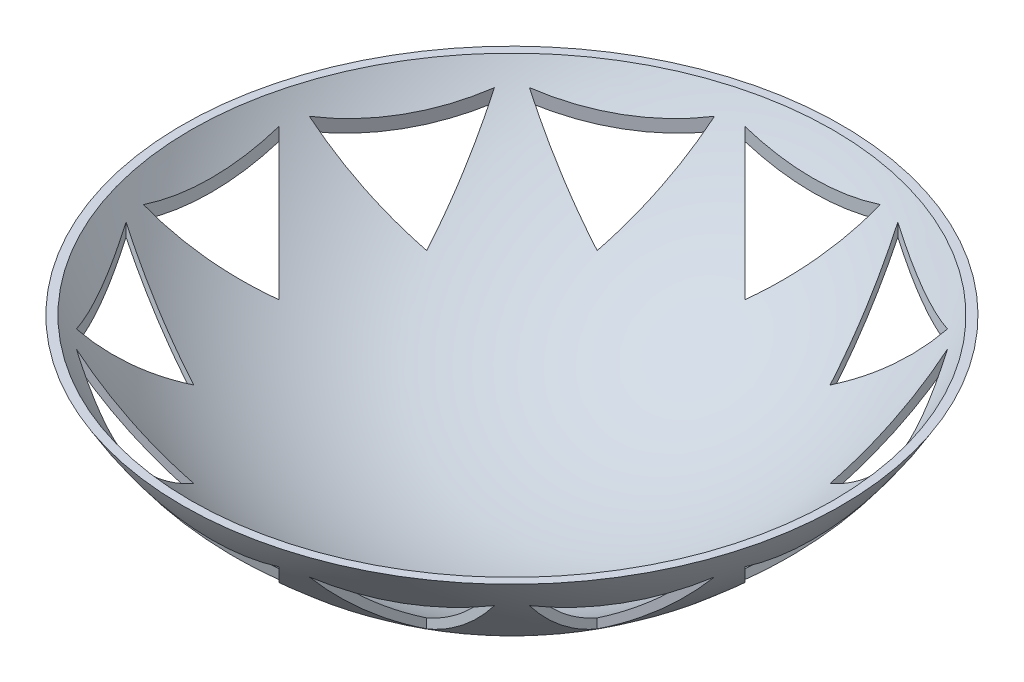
from build123d import *

# Parameters (mm, degrees)
SKETCH2_R      = 0.0005
EXTRUDE1_DEPTH = 81.950602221
EXTRUDE2_DEPTH = 81.950602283


with BuildPart() as part:
    # Sketch1 → Revolve4 (revolve)
    with BuildSketch(Plane.XY):
        with BuildLine():
            Line((43.301270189, -25), (44.452221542, -25))
            ThreePointArc((44.452221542, -25), (25.748786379, -44.022721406), (0, -51))
            Line((0, -51), (0, -50))
            ThreePointArc((0, -50), (25, -43.301270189), (43.301270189, -25))
        make_face()
    revolve(axis=Axis((0, 0, 0), (0, -1, 0)))

    # Sketch2 → Extrude1 (cut, through all)
    with BuildSketch(Plane(origin=(0, 0, 0), x_dir=(1, 0, 0), z_dir=(0, 1, 0))):
        with Locations(Location((0, 0, 0), (0, 0, 270))):
            Circle(SKETCH2_R)
    extrude(amount=-EXTRUDE1_DEPTH, mode=Mode.SUBTRACT)

    # Sketch3 → Extrude2 (cut, through all)
    with BuildSketch(Plane(origin=(0, 0, 0), x_dir=(1, 0, 0), z_dir=(0, 1, 0))):
        Polygon((31.4128506, 0), (40.552917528, 9.140066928), (40.552917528, -9.140066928), align=None)
        Polygon((27.204326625, -15.7064253), (39.689890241, -12.360928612), (30.549823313, -28.191988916), align=None)
        Polygon((15.7064253, -27.204326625), (28.191988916, -30.549823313), (12.360928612, -39.689890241), align=None)
        Polygon((0, -31.4128506), (9.140066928, -40.552917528), (-9.140066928, -40.552917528), align=None)
        Polygon((-15.7064253, -27.204326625), (-12.360928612, -39.689890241), (-28.191988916, -30.549823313), align=None)
        Polygon((-27.204326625, -15.7064253), (-30.549823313, -28.191988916), (-39.689890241, -12.360928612), align=None)
        Polygon((-31.4128506, 0), (-40.552917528, -9.140066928), (-40.552917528, 9.140066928), align=None)
        Polygon((-27.204326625, 15.7064253), (-39.689890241, 12.360928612), (-30.549823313, 28.191988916), align=None)
        Polygon((-15.7064253, 27.204326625), (-28.191988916, 30.549823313), (-12.360928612, 39.689890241), align=None)
        Polygon((0, 31.4128506), (-9.140066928, 40.552917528), (9.140066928, 40.552917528), align=None)
        Polygon((15.7064253, 27.204326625), (12.360928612, 39.689890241), (28.191988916, 30.549823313), align=None)
        Polygon((27.204326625, 15.7064253), (30.549823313, 28.191988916), (39.689890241, 12.360928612), align=None)
    extrude(amount=-EXTRUDE2_DEPTH, mode=Mode.SUBTRACT)


solid = part.part
